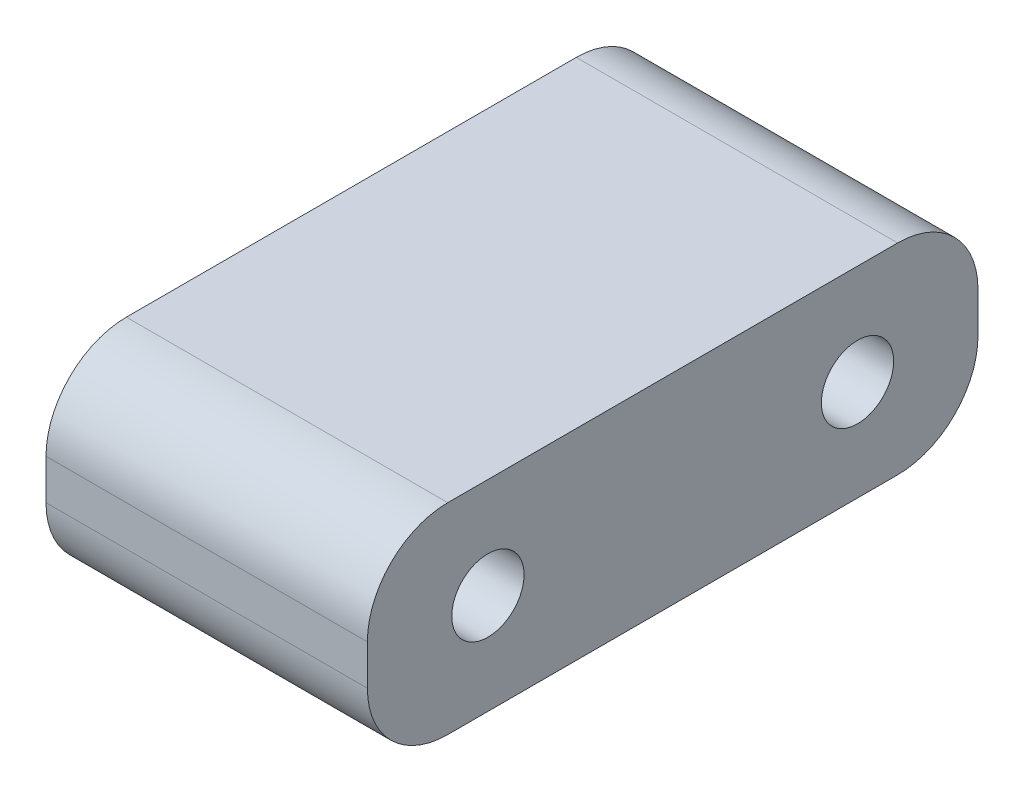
ISO-10303-21;
HEADER;
FILE_DESCRIPTION(('STEP AP214'),'2;1');
FILE_NAME('part.step','',(''),(''),'','','');
FILE_SCHEMA(('AUTOMOTIVE_DESIGN { 1 0 10303 214 1 1 1 1 }'));
ENDSEC;
DATA;
#1=APPLICATION_CONTEXT('core data for automotive mechanical design processes');
#2=APPLICATION_PROTOCOL_DEFINITION('international standard','automotive_design',2000,#1);
#3=PRODUCT_CONTEXT('',#1,'mechanical');
#4=PRODUCT('Part','Part','',(#3));
#5=PRODUCT_RELATED_PRODUCT_CATEGORY('part','',(#4));
#6=PRODUCT_DEFINITION_FORMATION('','',#4);
#7=PRODUCT_DEFINITION_CONTEXT('part definition',#1,'design');
#8=PRODUCT_DEFINITION('design','',#6,#7);
#9=PRODUCT_DEFINITION_SHAPE('','',#8);
#10=(LENGTH_UNIT() NAMED_UNIT(*) SI_UNIT(.MILLI.,.METRE.));
#11=(NAMED_UNIT(*) PLANE_ANGLE_UNIT() SI_UNIT($,.RADIAN.));
#12=(NAMED_UNIT(*) SI_UNIT($,.STERADIAN.) SOLID_ANGLE_UNIT());
#13=UNCERTAINTY_MEASURE_WITH_UNIT(LENGTH_MEASURE(1.E-05),#10,'distance_accuracy_value','');
#14=(GEOMETRIC_REPRESENTATION_CONTEXT(3) GLOBAL_UNCERTAINTY_ASSIGNED_CONTEXT((#13)) GLOBAL_UNIT_ASSIGNED_CONTEXT((#10,
#11,#12)) REPRESENTATION_CONTEXT('',''));
#15=CARTESIAN_POINT('',(0.,0.,0.));
#16=DIRECTION('',(0.,0.,1.));
#17=DIRECTION('',(1.,0.,0.));
#18=AXIS2_PLACEMENT_3D('',#15,#16,#17);
#19=CARTESIAN_POINT('',(10.,0.531417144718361,2.));
#20=DIRECTION('',(0.,1.,0.));
#21=DIRECTION('',(0.,0.,1.));
#22=AXIS2_PLACEMENT_3D('',#19,#20,#21);
#23=PLANE('',#22);
#24=DIRECTION('',(0.,0.,-1.));
#25=VECTOR('',#24,1.);
#26=CARTESIAN_POINT('',(10.,0.531417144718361,2.));
#27=LINE('',#26,#25);
#28=CARTESIAN_POINT('',(10.,0.531417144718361,-2.75000000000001));
#29=VERTEX_POINT('',#28);
#30=CARTESIAN_POINT('',(10.,0.531417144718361,-30.75));
#31=VERTEX_POINT('',#30);
#32=EDGE_CURVE('E87',#29,#31,#27,.T.);
#33=ORIENTED_EDGE('',*,*,#32,.F.);
#34=DIRECTION('',(-1.,0.,0.));
#35=VECTOR('',#34,1.);
#36=CARTESIAN_POINT('',(10.,0.531417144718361,-2.75000000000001));
#37=LINE('',#36,#35);
#38=CARTESIAN_POINT('',(-10.,0.531417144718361,-2.75000000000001));
#39=VERTEX_POINT('',#38);
#40=EDGE_CURVE('E200',#29,#39,#37,.T.);
#41=ORIENTED_EDGE('',*,*,#40,.T.);
#42=DIRECTION('',(0.,0.,-1.));
#43=VECTOR('',#42,1.);
#44=CARTESIAN_POINT('',(-10.,0.531417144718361,2.));
#45=LINE('',#44,#43);
#46=CARTESIAN_POINT('',(-10.,0.531417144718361,-30.75));
#47=VERTEX_POINT('',#46);
#48=EDGE_CURVE('E46',#39,#47,#45,.T.);
#49=ORIENTED_EDGE('',*,*,#48,.T.);
#50=DIRECTION('',(-1.,0.,0.));
#51=VECTOR('',#50,1.);
#52=CARTESIAN_POINT('',(10.,0.531417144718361,-30.75));
#53=LINE('',#52,#51);
#54=EDGE_CURVE('E104',#31,#47,#53,.T.);
#55=ORIENTED_EDGE('',*,*,#54,.F.);
#56=EDGE_LOOP('',(#33,#41,#49,#55));
#57=FACE_BOUND('',#56,.T.);
#58=ADVANCED_FACE('F43',(#57),#23,.F.);
#59=CARTESIAN_POINT('',(10.,13.0314171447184,2.));
#60=DIRECTION('',(0.,1.,0.));
#61=DIRECTION('',(0.,0.,1.));
#62=AXIS2_PLACEMENT_3D('',#59,#60,#61);
#63=PLANE('',#62);
#64=DIRECTION('',(0.,0.,-1.));
#65=VECTOR('',#64,1.);
#66=CARTESIAN_POINT('',(-10.,13.0314171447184,2.));
#67=LINE('',#66,#65);
#68=CARTESIAN_POINT('',(-10.,13.0314171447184,-2.75000000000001));
#69=VERTEX_POINT('',#68);
#70=CARTESIAN_POINT('',(-10.,13.0314171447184,-30.75));
#71=VERTEX_POINT('',#70);
#72=EDGE_CURVE('E130',#69,#71,#67,.T.);
#73=ORIENTED_EDGE('',*,*,#72,.F.);
#74=DIRECTION('',(-1.,0.,0.));
#75=VECTOR('',#74,1.);
#76=CARTESIAN_POINT('',(10.,13.0314171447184,-2.75000000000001));
#77=LINE('',#76,#75);
#78=CARTESIAN_POINT('',(10.,13.0314171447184,-2.75000000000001));
#79=VERTEX_POINT('',#78);
#80=EDGE_CURVE('E119',#79,#69,#77,.T.);
#81=ORIENTED_EDGE('',*,*,#80,.F.);
#82=DIRECTION('',(0.,0.,-1.));
#83=VECTOR('',#82,1.);
#84=CARTESIAN_POINT('',(10.,13.0314171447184,2.));
#85=LINE('',#84,#83);
#86=CARTESIAN_POINT('',(10.,13.0314171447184,-30.75));
#87=VERTEX_POINT('',#86);
#88=EDGE_CURVE('E126',#79,#87,#85,.T.);
#89=ORIENTED_EDGE('',*,*,#88,.T.);
#90=DIRECTION('',(-1.,0.,0.));
#91=VECTOR('',#90,1.);
#92=CARTESIAN_POINT('',(10.,13.0314171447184,-30.75));
#93=LINE('',#92,#91);
#94=EDGE_CURVE('E98',#87,#71,#93,.T.);
#95=ORIENTED_EDGE('',*,*,#94,.T.);
#96=EDGE_LOOP('',(#73,#81,#89,#95));
#97=FACE_BOUND('',#96,.T.);
#98=ADVANCED_FACE('F149',(#97),#63,.T.);
#99=CARTESIAN_POINT('',(10.,0.,2.));
#100=DIRECTION('',(1.,0.,0.));
#101=DIRECTION('',(0.,0.,-1.));
#102=AXIS2_PLACEMENT_3D('',#99,#100,#101);
#103=PLANE('',#102);
#104=ORIENTED_EDGE('',*,*,#88,.F.);
#105=CARTESIAN_POINT('',(10.,8.03141714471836,-2.75000000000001));
#106=DIRECTION('',(1.,0.,0.));
#107=DIRECTION('',(0.,0.,-1.));
#108=AXIS2_PLACEMENT_3D('',#105,#106,#107);
#109=CIRCLE('',#108,5.);
#110=CARTESIAN_POINT('',(10.,8.03141714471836,2.25));
#111=VERTEX_POINT('',#110);
#112=EDGE_CURVE('E193',#79,#111,#109,.T.);
#113=ORIENTED_EDGE('',*,*,#112,.T.);
#114=DIRECTION('',(0.,-1.,0.));
#115=VECTOR('',#114,1.);
#116=CARTESIAN_POINT('',(10.,0.,2.24999999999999));
#117=LINE('',#116,#115);
#118=CARTESIAN_POINT('',(10.,5.53141714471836,2.24999999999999));
#119=VERTEX_POINT('',#118);
#120=EDGE_CURVE('E196',#111,#119,#117,.T.);
#121=ORIENTED_EDGE('',*,*,#120,.T.);
#122=CARTESIAN_POINT('',(10.,5.53141714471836,-2.75000000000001));
#123=DIRECTION('',(1.,0.,0.));
#124=DIRECTION('',(0.,0.,-1.));
#125=AXIS2_PLACEMENT_3D('',#122,#123,#124);
#126=CIRCLE('',#125,5.);
#127=EDGE_CURVE('E93',#119,#29,#126,.T.);
#128=ORIENTED_EDGE('',*,*,#127,.T.);
#129=ORIENTED_EDGE('',*,*,#32,.T.);
#130=CARTESIAN_POINT('',(10.,5.53141714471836,-30.75));
#131=DIRECTION('',(1.,0.,0.));
#132=DIRECTION('',(0.,0.,-1.));
#133=AXIS2_PLACEMENT_3D('',#130,#131,#132);
#134=CIRCLE('',#133,5.);
#135=CARTESIAN_POINT('',(10.,5.53141714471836,-35.75));
#136=VERTEX_POINT('',#135);
#137=EDGE_CURVE('E82',#31,#136,#134,.T.);
#138=ORIENTED_EDGE('',*,*,#137,.T.);
#139=DIRECTION('',(0.,-1.,0.));
#140=VECTOR('',#139,1.);
#141=CARTESIAN_POINT('',(10.,0.,-35.75));
#142=LINE('',#141,#140);
#143=CARTESIAN_POINT('',(10.,8.03141714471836,-35.75));
#144=VERTEX_POINT('',#143);
#145=EDGE_CURVE('E111',#144,#136,#142,.T.);
#146=ORIENTED_EDGE('',*,*,#145,.F.);
#147=CARTESIAN_POINT('',(10.,8.03141714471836,-30.75));
#148=DIRECTION('',(1.,0.,0.));
#149=DIRECTION('',(0.,0.,-1.));
#150=AXIS2_PLACEMENT_3D('',#147,#148,#149);
#151=CIRCLE('',#150,4.99999999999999);
#152=EDGE_CURVE('E122',#87,#144,#151,.F.);
#153=ORIENTED_EDGE('',*,*,#152,.F.);
#154=EDGE_LOOP('',(#104,#113,#121,#128,#129,#138,#146,#153));
#155=FACE_BOUND('',#154,.T.);
#156=CARTESIAN_POINT('',(10.,6.78141714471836,-28.25));
#157=DIRECTION('',(1.,0.,0.));
#158=DIRECTION('',(0.,0.,-1.));
#159=AXIS2_PLACEMENT_3D('',#156,#157,#158);
#160=CIRCLE('',#159,2.25);
#161=CARTESIAN_POINT('',(10.,6.78141714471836,-30.5));
#162=VERTEX_POINT('',#161);
#163=EDGE_CURVE('E11',#162,#162,#160,.T.);
#164=ORIENTED_EDGE('',*,*,#163,.F.);
#165=EDGE_LOOP('',(#164));
#166=FACE_BOUND('',#165,.T.);
#167=CARTESIAN_POINT('',(10.,6.78141714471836,-5.25000000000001));
#168=DIRECTION('',(1.,0.,0.));
#169=DIRECTION('',(0.,0.,-1.));
#170=AXIS2_PLACEMENT_3D('',#167,#168,#169);
#171=CIRCLE('',#170,2.25);
#172=CARTESIAN_POINT('',(10.,6.78141714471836,-7.50000000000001));
#173=VERTEX_POINT('',#172);
#174=EDGE_CURVE('E186',#173,#173,#171,.T.);
#175=ORIENTED_EDGE('',*,*,#174,.F.);
#176=EDGE_LOOP('',(#175));
#177=FACE_BOUND('',#176,.T.);
#178=ADVANCED_FACE('F89',(#155,#166,#177),#103,.T.);
#179=CARTESIAN_POINT('',(-10.,0.,2.));
#180=DIRECTION('',(1.,0.,0.));
#181=DIRECTION('',(0.,0.,-1.));
#182=AXIS2_PLACEMENT_3D('',#179,#180,#181);
#183=PLANE('',#182);
#184=CARTESIAN_POINT('',(-10.,6.78141714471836,-28.25));
#185=DIRECTION('',(1.,0.,0.));
#186=DIRECTION('',(0.,0.,-1.));
#187=AXIS2_PLACEMENT_3D('',#184,#185,#186);
#188=CIRCLE('',#187,2.25);
#189=CARTESIAN_POINT('',(-10.,6.78141714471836,-30.5));
#190=VERTEX_POINT('',#189);
#191=EDGE_CURVE('E107',#190,#190,#188,.T.);
#192=ORIENTED_EDGE('',*,*,#191,.T.);
#193=EDGE_LOOP('',(#192));
#194=FACE_BOUND('',#193,.T.);
#195=ORIENTED_EDGE('',*,*,#48,.F.);
#196=CARTESIAN_POINT('',(-10.,5.53141714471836,-2.75000000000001));
#197=DIRECTION('',(1.,0.,0.));
#198=DIRECTION('',(0.,0.,-1.));
#199=AXIS2_PLACEMENT_3D('',#196,#197,#198);
#200=CIRCLE('',#199,5.);
#201=CARTESIAN_POINT('',(-10.,5.53141714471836,2.24999999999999));
#202=VERTEX_POINT('',#201);
#203=EDGE_CURVE('E197',#202,#39,#200,.T.);
#204=ORIENTED_EDGE('',*,*,#203,.F.);
#205=DIRECTION('',(0.,-1.,0.));
#206=VECTOR('',#205,1.);
#207=CARTESIAN_POINT('',(-10.,0.,2.24999999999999));
#208=LINE('',#207,#206);
#209=CARTESIAN_POINT('',(-10.,8.03141714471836,2.25));
#210=VERTEX_POINT('',#209);
#211=EDGE_CURVE('E202',#210,#202,#208,.T.);
#212=ORIENTED_EDGE('',*,*,#211,.F.);
#213=CARTESIAN_POINT('',(-10.,8.03141714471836,-2.75000000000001));
#214=DIRECTION('',(1.,0.,0.));
#215=DIRECTION('',(0.,0.,-1.));
#216=AXIS2_PLACEMENT_3D('',#213,#214,#215);
#217=CIRCLE('',#216,5.);
#218=EDGE_CURVE('E144',#69,#210,#217,.T.);
#219=ORIENTED_EDGE('',*,*,#218,.F.);
#220=ORIENTED_EDGE('',*,*,#72,.T.);
#221=CARTESIAN_POINT('',(-10.,8.03141714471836,-30.75));
#222=DIRECTION('',(1.,0.,0.));
#223=DIRECTION('',(0.,0.,-1.));
#224=AXIS2_PLACEMENT_3D('',#221,#222,#223);
#225=CIRCLE('',#224,4.99999999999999);
#226=CARTESIAN_POINT('',(-10.,8.03141714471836,-35.75));
#227=VERTEX_POINT('',#226);
#228=EDGE_CURVE('E127',#71,#227,#225,.F.);
#229=ORIENTED_EDGE('',*,*,#228,.T.);
#230=DIRECTION('',(0.,-1.,0.));
#231=VECTOR('',#230,1.);
#232=CARTESIAN_POINT('',(-10.,0.,-35.75));
#233=LINE('',#232,#231);
#234=CARTESIAN_POINT('',(-10.,5.53141714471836,-35.75));
#235=VERTEX_POINT('',#234);
#236=EDGE_CURVE('E115',#227,#235,#233,.T.);
#237=ORIENTED_EDGE('',*,*,#236,.T.);
#238=CARTESIAN_POINT('',(-10.,5.53141714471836,-30.75));
#239=DIRECTION('',(1.,0.,0.));
#240=DIRECTION('',(0.,0.,-1.));
#241=AXIS2_PLACEMENT_3D('',#238,#239,#240);
#242=CIRCLE('',#241,5.);
#243=EDGE_CURVE('E112',#47,#235,#242,.T.);
#244=ORIENTED_EDGE('',*,*,#243,.F.);
#245=EDGE_LOOP('',(#195,#204,#212,#219,#220,#229,#237,#244));
#246=FACE_BOUND('',#245,.T.);
#247=CARTESIAN_POINT('',(-10.,6.78141714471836,-5.25000000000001));
#248=DIRECTION('',(1.,0.,0.));
#249=DIRECTION('',(0.,0.,-1.));
#250=AXIS2_PLACEMENT_3D('',#247,#248,#249);
#251=CIRCLE('',#250,2.25);
#252=CARTESIAN_POINT('',(-10.,6.78141714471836,-7.50000000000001));
#253=VERTEX_POINT('',#252);
#254=EDGE_CURVE('E188',#253,#253,#251,.T.);
#255=ORIENTED_EDGE('',*,*,#254,.T.);
#256=EDGE_LOOP('',(#255));
#257=FACE_BOUND('',#256,.T.);
#258=ADVANCED_FACE('F139',(#194,#246,#257),#183,.F.);
#259=CARTESIAN_POINT('',(10.,5.53141714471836,-30.75));
#260=DIRECTION('',(-1.,0.,0.));
#261=DIRECTION('',(0.,0.,1.));
#262=AXIS2_PLACEMENT_3D('',#259,#260,#261);
#263=CYLINDRICAL_SURFACE('',#262,5.);
#264=ORIENTED_EDGE('',*,*,#243,.T.);
#265=DIRECTION('',(-1.,0.,0.));
#266=VECTOR('',#265,1.);
#267=CARTESIAN_POINT('',(10.,5.53141714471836,-35.75));
#268=LINE('',#267,#266);
#269=EDGE_CURVE('E105',#136,#235,#268,.T.);
#270=ORIENTED_EDGE('',*,*,#269,.F.);
#271=ORIENTED_EDGE('',*,*,#137,.F.);
#272=ORIENTED_EDGE('',*,*,#54,.T.);
#273=EDGE_LOOP('',(#264,#270,#271,#272));
#274=FACE_BOUND('',#273,.T.);
#275=ADVANCED_FACE('F103',(#274),#263,.T.);
#276=CARTESIAN_POINT('',(10.,0.,-35.75));
#277=DIRECTION('',(0.,0.,-1.));
#278=DIRECTION('',(-1.,0.,0.));
#279=AXIS2_PLACEMENT_3D('',#276,#277,#278);
#280=PLANE('',#279);
#281=ORIENTED_EDGE('',*,*,#236,.F.);
#282=DIRECTION('',(-1.,0.,0.));
#283=VECTOR('',#282,1.);
#284=CARTESIAN_POINT('',(10.,8.03141714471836,-35.75));
#285=LINE('',#284,#283);
#286=EDGE_CURVE('E52',#144,#227,#285,.T.);
#287=ORIENTED_EDGE('',*,*,#286,.F.);
#288=ORIENTED_EDGE('',*,*,#145,.T.);
#289=ORIENTED_EDGE('',*,*,#269,.T.);
#290=EDGE_LOOP('',(#281,#287,#288,#289));
#291=FACE_BOUND('',#290,.T.);
#292=ADVANCED_FACE('F154',(#291),#280,.T.);
#293=CARTESIAN_POINT('',(10.,8.03141714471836,-30.75));
#294=DIRECTION('',(-1.,0.,0.));
#295=DIRECTION('',(0.,0.,1.));
#296=AXIS2_PLACEMENT_3D('',#293,#294,#295);
#297=CYLINDRICAL_SURFACE('',#296,4.99999999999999);
#298=ORIENTED_EDGE('',*,*,#228,.F.);
#299=ORIENTED_EDGE('',*,*,#94,.F.);
#300=ORIENTED_EDGE('',*,*,#152,.T.);
#301=ORIENTED_EDGE('',*,*,#286,.T.);
#302=EDGE_LOOP('',(#298,#299,#300,#301));
#303=FACE_BOUND('',#302,.T.);
#304=ADVANCED_FACE('F151',(#303),#297,.T.);
#305=CARTESIAN_POINT('',(-10.,6.78141714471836,-28.25));
#306=DIRECTION('',(1.,0.,0.));
#307=DIRECTION('',(0.,0.,-1.));
#308=AXIS2_PLACEMENT_3D('',#305,#306,#307);
#309=CYLINDRICAL_SURFACE('',#308,2.25);
#310=ORIENTED_EDGE('',*,*,#191,.F.);
#311=EDGE_LOOP('',(#310));
#312=FACE_BOUND('',#311,.T.);
#313=ORIENTED_EDGE('',*,*,#163,.T.);
#314=EDGE_LOOP('',(#313));
#315=FACE_BOUND('',#314,.T.);
#316=ADVANCED_FACE('F153',(#312,#315),#309,.F.);
#317=CARTESIAN_POINT('',(10.,8.03141714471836,-2.75000000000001));
#318=DIRECTION('',(-1.,0.,0.));
#319=DIRECTION('',(0.,0.,1.));
#320=AXIS2_PLACEMENT_3D('',#317,#318,#319);
#321=CYLINDRICAL_SURFACE('',#320,5.);
#322=ORIENTED_EDGE('',*,*,#218,.T.);
#323=DIRECTION('',(-1.,0.,0.));
#324=VECTOR('',#323,1.);
#325=CARTESIAN_POINT('',(10.,8.03141714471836,2.25));
#326=LINE('',#325,#324);
#327=EDGE_CURVE('E210',#111,#210,#326,.T.);
#328=ORIENTED_EDGE('',*,*,#327,.F.);
#329=ORIENTED_EDGE('',*,*,#112,.F.);
#330=ORIENTED_EDGE('',*,*,#80,.T.);
#331=EDGE_LOOP('',(#322,#328,#329,#330));
#332=FACE_BOUND('',#331,.T.);
#333=ADVANCED_FACE('F160',(#332),#321,.T.);
#334=CARTESIAN_POINT('',(10.,0.,2.24999999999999));
#335=DIRECTION('',(0.,0.,-1.));
#336=DIRECTION('',(0.,1.,0.));
#337=AXIS2_PLACEMENT_3D('',#334,#335,#336);
#338=PLANE('',#337);
#339=ORIENTED_EDGE('',*,*,#211,.T.);
#340=DIRECTION('',(-1.,0.,0.));
#341=VECTOR('',#340,1.);
#342=CARTESIAN_POINT('',(10.,5.53141714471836,2.24999999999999));
#343=LINE('',#342,#341);
#344=EDGE_CURVE('E208',#119,#202,#343,.T.);
#345=ORIENTED_EDGE('',*,*,#344,.F.);
#346=ORIENTED_EDGE('',*,*,#120,.F.);
#347=ORIENTED_EDGE('',*,*,#327,.T.);
#348=EDGE_LOOP('',(#339,#345,#346,#347));
#349=FACE_BOUND('',#348,.T.);
#350=ADVANCED_FACE('F231',(#349),#338,.F.);
#351=CARTESIAN_POINT('',(10.,5.53141714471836,-2.75000000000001));
#352=DIRECTION('',(-1.,0.,0.));
#353=DIRECTION('',(0.,0.,1.));
#354=AXIS2_PLACEMENT_3D('',#351,#352,#353);
#355=CYLINDRICAL_SURFACE('',#354,5.);
#356=ORIENTED_EDGE('',*,*,#203,.T.);
#357=ORIENTED_EDGE('',*,*,#40,.F.);
#358=ORIENTED_EDGE('',*,*,#127,.F.);
#359=ORIENTED_EDGE('',*,*,#344,.T.);
#360=EDGE_LOOP('',(#356,#357,#358,#359));
#361=FACE_BOUND('',#360,.T.);
#362=ADVANCED_FACE('F234',(#361),#355,.T.);
#363=CARTESIAN_POINT('',(-10.,6.78141714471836,-5.25000000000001));
#364=DIRECTION('',(1.,0.,0.));
#365=DIRECTION('',(0.,0.,-1.));
#366=AXIS2_PLACEMENT_3D('',#363,#364,#365);
#367=CYLINDRICAL_SURFACE('',#366,2.25);
#368=ORIENTED_EDGE('',*,*,#254,.F.);
#369=EDGE_LOOP('',(#368));
#370=FACE_BOUND('',#369,.T.);
#371=ORIENTED_EDGE('',*,*,#174,.T.);
#372=EDGE_LOOP('',(#371));
#373=FACE_BOUND('',#372,.T.);
#374=ADVANCED_FACE('F236',(#370,#373),#367,.F.);
#375=CLOSED_SHELL('',(#58,#98,#178,#258,#275,#292,#304,#316,#333,#350,#362,#374));
#376=MANIFOLD_SOLID_BREP('B2',#375);
#377=ADVANCED_BREP_SHAPE_REPRESENTATION('',(#18,#376),#14);
#378=SHAPE_DEFINITION_REPRESENTATION(#9,#377);
ENDSEC;
END-ISO-10303-21;
